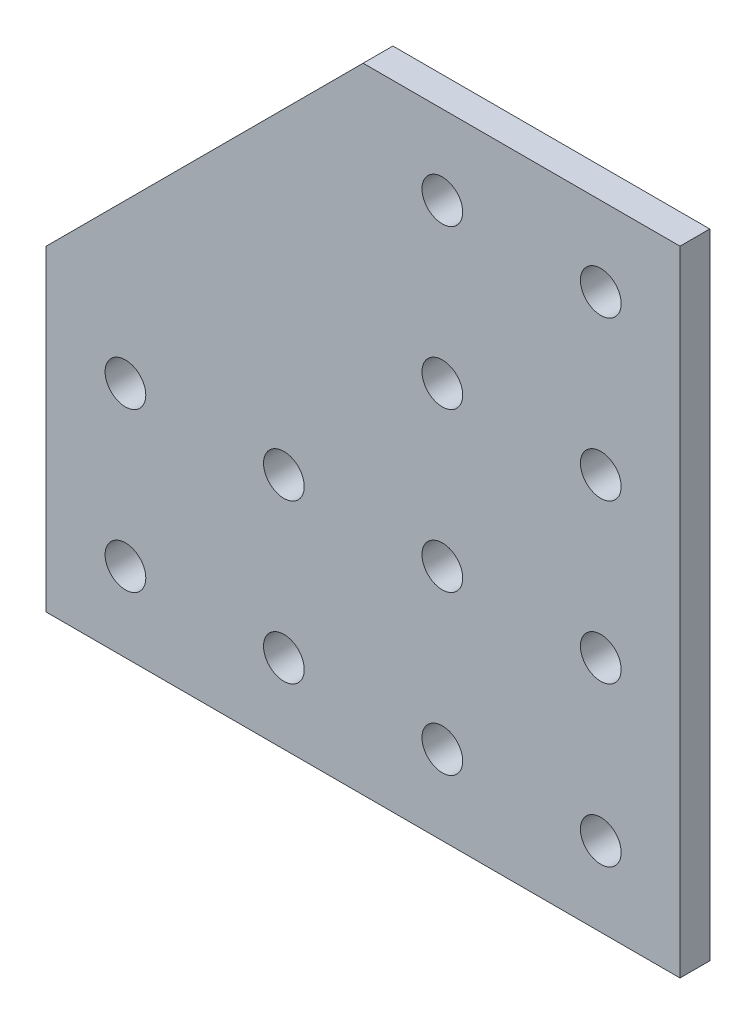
ISO-10303-21;
HEADER;
FILE_DESCRIPTION(('STEP AP214'),'2;1');
FILE_NAME('part.step','',(''),(''),'','','');
FILE_SCHEMA(('AUTOMOTIVE_DESIGN { 1 0 10303 214 1 1 1 1 }'));
ENDSEC;
DATA;
#1=APPLICATION_CONTEXT('core data for automotive mechanical design processes');
#2=APPLICATION_PROTOCOL_DEFINITION('international standard','automotive_design',2000,#1);
#3=PRODUCT_CONTEXT('',#1,'mechanical');
#4=PRODUCT('Part','Part','',(#3));
#5=PRODUCT_RELATED_PRODUCT_CATEGORY('part','',(#4));
#6=PRODUCT_DEFINITION_FORMATION('','',#4);
#7=PRODUCT_DEFINITION_CONTEXT('part definition',#1,'design');
#8=PRODUCT_DEFINITION('design','',#6,#7);
#9=PRODUCT_DEFINITION_SHAPE('','',#8);
#10=(LENGTH_UNIT() NAMED_UNIT(*) SI_UNIT(.MILLI.,.METRE.));
#11=(NAMED_UNIT(*) PLANE_ANGLE_UNIT() SI_UNIT($,.RADIAN.));
#12=(NAMED_UNIT(*) SI_UNIT($,.STERADIAN.) SOLID_ANGLE_UNIT());
#13=UNCERTAINTY_MEASURE_WITH_UNIT(LENGTH_MEASURE(1.E-05),#10,'distance_accuracy_value','');
#14=(GEOMETRIC_REPRESENTATION_CONTEXT(3) GLOBAL_UNCERTAINTY_ASSIGNED_CONTEXT((#13)) GLOBAL_UNIT_ASSIGNED_CONTEXT((#10,
#11,#12)) REPRESENTATION_CONTEXT('',''));
#15=CARTESIAN_POINT('',(0.,0.,0.));
#16=DIRECTION('',(0.,0.,1.));
#17=DIRECTION('',(1.,0.,0.));
#18=AXIS2_PLACEMENT_3D('',#15,#16,#17);
#19=CARTESIAN_POINT('',(1.11022302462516E-13,0.,4.77519999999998));
#20=DIRECTION('',(0.,0.,1.));
#21=DIRECTION('',(1.,0.,0.));
#22=AXIS2_PLACEMENT_3D('',#19,#20,#21);
#23=PLANE('',#22);
#24=CARTESIAN_POINT('',(-38.1,38.1,4.77520000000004));
#25=DIRECTION('',(0.,0.,1.));
#26=DIRECTION('',(1.,0.,0.));
#27=AXIS2_PLACEMENT_3D('',#24,#25,#26);
#28=CIRCLE('',#27,3.2639);
#29=CARTESIAN_POINT('',(-34.8361,38.1,4.77520000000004));
#30=VERTEX_POINT('',#29);
#31=EDGE_CURVE('E203',#30,#30,#28,.T.);
#32=ORIENTED_EDGE('',*,*,#31,.F.);
#33=EDGE_LOOP('',(#32));
#34=FACE_BOUND('',#33,.T.);
#35=CARTESIAN_POINT('',(-12.6999999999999,38.1,4.77519999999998));
#36=DIRECTION('',(0.,0.,1.));
#37=DIRECTION('',(1.,0.,0.));
#38=AXIS2_PLACEMENT_3D('',#35,#36,#37);
#39=CIRCLE('',#38,3.2639);
#40=CARTESIAN_POINT('',(-9.43609999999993,38.1,4.77519999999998));
#41=VERTEX_POINT('',#40);
#42=EDGE_CURVE('E215',#41,#41,#39,.T.);
#43=ORIENTED_EDGE('',*,*,#42,.F.);
#44=EDGE_LOOP('',(#43));
#45=FACE_BOUND('',#44,.T.);
#46=CARTESIAN_POINT('',(12.7,38.1,4.77519999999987));
#47=DIRECTION('',(0.,0.,1.));
#48=DIRECTION('',(1.,0.,0.));
#49=AXIS2_PLACEMENT_3D('',#46,#47,#48);
#50=CIRCLE('',#49,3.2639);
#51=CARTESIAN_POINT('',(15.9639,38.1,4.77519999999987));
#52=VERTEX_POINT('',#51);
#53=EDGE_CURVE('E227',#52,#52,#50,.T.);
#54=ORIENTED_EDGE('',*,*,#53,.F.);
#55=EDGE_LOOP('',(#54));
#56=FACE_BOUND('',#55,.T.);
#57=CARTESIAN_POINT('',(12.7,88.9,4.77519999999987));
#58=DIRECTION('',(0.,0.,1.));
#59=DIRECTION('',(1.,0.,0.));
#60=AXIS2_PLACEMENT_3D('',#57,#58,#59);
#61=CIRCLE('',#60,3.2639);
#62=CARTESIAN_POINT('',(15.9639,88.9,4.77519999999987));
#63=VERTEX_POINT('',#62);
#64=EDGE_CURVE('E239',#63,#63,#61,.T.);
#65=ORIENTED_EDGE('',*,*,#64,.F.);
#66=EDGE_LOOP('',(#65));
#67=FACE_BOUND('',#66,.T.);
#68=CARTESIAN_POINT('',(38.1000000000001,38.1,4.77519999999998));
#69=DIRECTION('',(0.,0.,1.));
#70=DIRECTION('',(1.,0.,0.));
#71=AXIS2_PLACEMENT_3D('',#68,#69,#70);
#72=CIRCLE('',#71,3.2639);
#73=CARTESIAN_POINT('',(41.3639000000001,38.1,4.77519999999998));
#74=VERTEX_POINT('',#73);
#75=EDGE_CURVE('E251',#74,#74,#72,.T.);
#76=ORIENTED_EDGE('',*,*,#75,.F.);
#77=EDGE_LOOP('',(#76));
#78=FACE_BOUND('',#77,.T.);
#79=CARTESIAN_POINT('',(38.1000000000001,88.9,4.77519999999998));
#80=DIRECTION('',(0.,0.,1.));
#81=DIRECTION('',(1.,0.,0.));
#82=AXIS2_PLACEMENT_3D('',#79,#80,#81);
#83=CIRCLE('',#82,3.2639);
#84=CARTESIAN_POINT('',(41.3639000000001,88.9,4.77519999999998));
#85=VERTEX_POINT('',#84);
#86=EDGE_CURVE('E110',#85,#85,#83,.T.);
#87=ORIENTED_EDGE('',*,*,#86,.F.);
#88=EDGE_LOOP('',(#87));
#89=FACE_BOUND('',#88,.T.);
#90=DIRECTION('',(0.,-1.,0.));
#91=VECTOR('',#90,1.);
#92=CARTESIAN_POINT('',(-50.7999999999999,50.8,4.77519999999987));
#93=LINE('',#92,#91);
#94=CARTESIAN_POINT('',(-50.7999999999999,50.8,4.77519999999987));
#95=VERTEX_POINT('',#94);
#96=CARTESIAN_POINT('',(-50.7999999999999,0.,4.77519999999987));
#97=VERTEX_POINT('',#96);
#98=EDGE_CURVE('E115',#95,#97,#93,.T.);
#99=ORIENTED_EDGE('',*,*,#98,.T.);
#100=DIRECTION('',(1.,0.,0.));
#101=VECTOR('',#100,1.);
#102=CARTESIAN_POINT('',(-50.7999999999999,0.,4.77519999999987));
#103=LINE('',#102,#101);
#104=CARTESIAN_POINT('',(50.8000000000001,0.,4.77519999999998));
#105=VERTEX_POINT('',#104);
#106=EDGE_CURVE('E82',#97,#105,#103,.T.);
#107=ORIENTED_EDGE('',*,*,#106,.T.);
#108=DIRECTION('',(0.,1.,0.));
#109=VECTOR('',#108,1.);
#110=CARTESIAN_POINT('',(50.8000000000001,0.,4.77519999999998));
#111=LINE('',#110,#109);
#112=CARTESIAN_POINT('',(50.8000000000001,101.6,4.77519999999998));
#113=VERTEX_POINT('',#112);
#114=EDGE_CURVE('E86',#105,#113,#111,.T.);
#115=ORIENTED_EDGE('',*,*,#114,.T.);
#116=DIRECTION('',(-1.,0.,0.));
#117=VECTOR('',#116,1.);
#118=CARTESIAN_POINT('',(50.8000000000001,101.6,4.77519999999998));
#119=LINE('',#118,#117);
#120=CARTESIAN_POINT('',(1.11022302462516E-13,101.6,4.77519999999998));
#121=VERTEX_POINT('',#120);
#122=EDGE_CURVE('E90',#113,#121,#119,.T.);
#123=ORIENTED_EDGE('',*,*,#122,.T.);
#124=DIRECTION('',(-0.707106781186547,-0.707106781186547,0.));
#125=VECTOR('',#124,1.);
#126=CARTESIAN_POINT('',(1.11022302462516E-13,101.6,4.77519999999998));
#127=LINE('',#126,#125);
#128=EDGE_CURVE('E48',#121,#95,#127,.T.);
#129=ORIENTED_EDGE('',*,*,#128,.T.);
#130=EDGE_LOOP('',(#99,#107,#115,#123,#129));
#131=FACE_BOUND('',#130,.T.);
#132=CARTESIAN_POINT('',(38.1000000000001,63.5,4.77519999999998));
#133=DIRECTION('',(0.,0.,1.));
#134=DIRECTION('',(1.,0.,0.));
#135=AXIS2_PLACEMENT_3D('',#132,#133,#134);
#136=CIRCLE('',#135,3.2639);
#137=CARTESIAN_POINT('',(41.3639000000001,63.5,4.77519999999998));
#138=VERTEX_POINT('',#137);
#139=EDGE_CURVE('E257',#138,#138,#136,.T.);
#140=ORIENTED_EDGE('',*,*,#139,.F.);
#141=EDGE_LOOP('',(#140));
#142=FACE_BOUND('',#141,.T.);
#143=CARTESIAN_POINT('',(38.1000000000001,12.7,4.77519999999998));
#144=DIRECTION('',(0.,0.,1.));
#145=DIRECTION('',(1.,0.,0.));
#146=AXIS2_PLACEMENT_3D('',#143,#144,#145);
#147=CIRCLE('',#146,3.2639);
#148=CARTESIAN_POINT('',(41.3639000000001,12.7,4.77519999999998));
#149=VERTEX_POINT('',#148);
#150=EDGE_CURVE('E245',#149,#149,#147,.T.);
#151=ORIENTED_EDGE('',*,*,#150,.F.);
#152=EDGE_LOOP('',(#151));
#153=FACE_BOUND('',#152,.T.);
#154=CARTESIAN_POINT('',(12.7,63.5,4.77519999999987));
#155=DIRECTION('',(0.,0.,1.));
#156=DIRECTION('',(1.,0.,0.));
#157=AXIS2_PLACEMENT_3D('',#154,#155,#156);
#158=CIRCLE('',#157,3.2639);
#159=CARTESIAN_POINT('',(15.9639,63.5,4.77519999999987));
#160=VERTEX_POINT('',#159);
#161=EDGE_CURVE('E233',#160,#160,#158,.T.);
#162=ORIENTED_EDGE('',*,*,#161,.F.);
#163=EDGE_LOOP('',(#162));
#164=FACE_BOUND('',#163,.T.);
#165=CARTESIAN_POINT('',(12.7,12.7,4.77519999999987));
#166=DIRECTION('',(0.,0.,1.));
#167=DIRECTION('',(1.,0.,0.));
#168=AXIS2_PLACEMENT_3D('',#165,#166,#167);
#169=CIRCLE('',#168,3.2639);
#170=CARTESIAN_POINT('',(15.9639,12.7,4.77519999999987));
#171=VERTEX_POINT('',#170);
#172=EDGE_CURVE('E221',#171,#171,#169,.T.);
#173=ORIENTED_EDGE('',*,*,#172,.F.);
#174=EDGE_LOOP('',(#173));
#175=FACE_BOUND('',#174,.T.);
#176=CARTESIAN_POINT('',(-12.6999999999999,12.7,4.77519999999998));
#177=DIRECTION('',(0.,0.,1.));
#178=DIRECTION('',(1.,0.,0.));
#179=AXIS2_PLACEMENT_3D('',#176,#177,#178);
#180=CIRCLE('',#179,3.2639);
#181=CARTESIAN_POINT('',(-9.43609999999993,12.7,4.77519999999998));
#182=VERTEX_POINT('',#181);
#183=EDGE_CURVE('E209',#182,#182,#180,.T.);
#184=ORIENTED_EDGE('',*,*,#183,.F.);
#185=EDGE_LOOP('',(#184));
#186=FACE_BOUND('',#185,.T.);
#187=CARTESIAN_POINT('',(-38.1,12.7,4.77520000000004));
#188=DIRECTION('',(0.,0.,1.));
#189=DIRECTION('',(1.,0.,0.));
#190=AXIS2_PLACEMENT_3D('',#187,#188,#189);
#191=CIRCLE('',#190,3.2639);
#192=CARTESIAN_POINT('',(-34.8361,12.7,4.77520000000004));
#193=VERTEX_POINT('',#192);
#194=EDGE_CURVE('E194',#193,#193,#191,.T.);
#195=ORIENTED_EDGE('',*,*,#194,.F.);
#196=EDGE_LOOP('',(#195));
#197=FACE_BOUND('',#196,.T.);
#198=ADVANCED_FACE('F31',(#34,#45,#56,#67,#78,#89,#131,#142,#153,#164,#175,#186,#197),#23,.T.);
#199=CARTESIAN_POINT('',(0.,0.,0.));
#200=DIRECTION('',(0.,0.,1.));
#201=DIRECTION('',(1.,0.,0.));
#202=AXIS2_PLACEMENT_3D('',#199,#200,#201);
#203=PLANE('',#202);
#204=CARTESIAN_POINT('',(-38.0999999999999,38.1,0.));
#205=DIRECTION('',(0.,0.,1.));
#206=DIRECTION('',(1.,0.,0.));
#207=AXIS2_PLACEMENT_3D('',#204,#205,#206);
#208=CIRCLE('',#207,3.2639);
#209=CARTESIAN_POINT('',(-34.8360999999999,38.1,0.));
#210=VERTEX_POINT('',#209);
#211=EDGE_CURVE('E200',#210,#210,#208,.T.);
#212=ORIENTED_EDGE('',*,*,#211,.T.);
#213=EDGE_LOOP('',(#212));
#214=FACE_BOUND('',#213,.T.);
#215=CARTESIAN_POINT('',(-12.7,38.1,0.));
#216=DIRECTION('',(0.,0.,1.));
#217=DIRECTION('',(1.,0.,0.));
#218=AXIS2_PLACEMENT_3D('',#215,#216,#217);
#219=CIRCLE('',#218,3.2639);
#220=CARTESIAN_POINT('',(-9.43609999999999,38.1,0.));
#221=VERTEX_POINT('',#220);
#222=EDGE_CURVE('E212',#221,#221,#219,.T.);
#223=ORIENTED_EDGE('',*,*,#222,.T.);
#224=EDGE_LOOP('',(#223));
#225=FACE_BOUND('',#224,.T.);
#226=CARTESIAN_POINT('',(12.7,38.1,-1.66533453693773E-13));
#227=DIRECTION('',(0.,0.,1.));
#228=DIRECTION('',(1.,0.,0.));
#229=AXIS2_PLACEMENT_3D('',#226,#227,#228);
#230=CIRCLE('',#229,3.2639);
#231=CARTESIAN_POINT('',(15.9639,38.1,-1.66533453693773E-13));
#232=VERTEX_POINT('',#231);
#233=EDGE_CURVE('E224',#232,#232,#230,.T.);
#234=ORIENTED_EDGE('',*,*,#233,.T.);
#235=EDGE_LOOP('',(#234));
#236=FACE_BOUND('',#235,.T.);
#237=CARTESIAN_POINT('',(12.7,88.9,-1.66533453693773E-13));
#238=DIRECTION('',(0.,0.,1.));
#239=DIRECTION('',(1.,0.,0.));
#240=AXIS2_PLACEMENT_3D('',#237,#238,#239);
#241=CIRCLE('',#240,3.2639);
#242=CARTESIAN_POINT('',(15.9639,88.9,-1.66533453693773E-13));
#243=VERTEX_POINT('',#242);
#244=EDGE_CURVE('E236',#243,#243,#241,.T.);
#245=ORIENTED_EDGE('',*,*,#244,.T.);
#246=EDGE_LOOP('',(#245));
#247=FACE_BOUND('',#246,.T.);
#248=CARTESIAN_POINT('',(38.1,38.1,0.));
#249=DIRECTION('',(0.,0.,1.));
#250=DIRECTION('',(1.,0.,0.));
#251=AXIS2_PLACEMENT_3D('',#248,#249,#250);
#252=CIRCLE('',#251,3.2639);
#253=CARTESIAN_POINT('',(41.3639,38.1,0.));
#254=VERTEX_POINT('',#253);
#255=EDGE_CURVE('E248',#254,#254,#252,.T.);
#256=ORIENTED_EDGE('',*,*,#255,.T.);
#257=EDGE_LOOP('',(#256));
#258=FACE_BOUND('',#257,.T.);
#259=CARTESIAN_POINT('',(38.1,88.9,0.));
#260=DIRECTION('',(0.,0.,1.));
#261=DIRECTION('',(1.,0.,0.));
#262=AXIS2_PLACEMENT_3D('',#259,#260,#261);
#263=CIRCLE('',#262,3.2639);
#264=CARTESIAN_POINT('',(41.3639,88.9,0.));
#265=VERTEX_POINT('',#264);
#266=EDGE_CURVE('E260',#265,#265,#263,.T.);
#267=ORIENTED_EDGE('',*,*,#266,.T.);
#268=EDGE_LOOP('',(#267));
#269=FACE_BOUND('',#268,.T.);
#270=DIRECTION('',(0.,-1.,0.));
#271=VECTOR('',#270,1.);
#272=CARTESIAN_POINT('',(-50.8,50.8,-1.66533453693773E-13));
#273=LINE('',#272,#271);
#274=CARTESIAN_POINT('',(-50.8,50.8,-1.66533453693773E-13));
#275=VERTEX_POINT('',#274);
#276=CARTESIAN_POINT('',(-50.8,0.,-1.66533453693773E-13));
#277=VERTEX_POINT('',#276);
#278=EDGE_CURVE('E106',#275,#277,#273,.T.);
#279=ORIENTED_EDGE('',*,*,#278,.F.);
#280=DIRECTION('',(-0.707106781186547,-0.707106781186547,0.));
#281=VECTOR('',#280,1.);
#282=CARTESIAN_POINT('',(0.,101.6,0.));
#283=LINE('',#282,#281);
#284=CARTESIAN_POINT('',(0.,101.6,0.));
#285=VERTEX_POINT('',#284);
#286=EDGE_CURVE('E74',#285,#275,#283,.T.);
#287=ORIENTED_EDGE('',*,*,#286,.F.);
#288=DIRECTION('',(-1.,0.,0.));
#289=VECTOR('',#288,1.);
#290=CARTESIAN_POINT('',(50.8,101.6,0.));
#291=LINE('',#290,#289);
#292=CARTESIAN_POINT('',(50.8,101.6,0.));
#293=VERTEX_POINT('',#292);
#294=EDGE_CURVE('E68',#293,#285,#291,.T.);
#295=ORIENTED_EDGE('',*,*,#294,.F.);
#296=DIRECTION('',(0.,1.,0.));
#297=VECTOR('',#296,1.);
#298=CARTESIAN_POINT('',(50.8,0.,0.));
#299=LINE('',#298,#297);
#300=CARTESIAN_POINT('',(50.8,0.,0.));
#301=VERTEX_POINT('',#300);
#302=EDGE_CURVE('E97',#301,#293,#299,.T.);
#303=ORIENTED_EDGE('',*,*,#302,.F.);
#304=DIRECTION('',(1.,0.,0.));
#305=VECTOR('',#304,1.);
#306=CARTESIAN_POINT('',(-50.8,0.,-1.66533453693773E-13));
#307=LINE('',#306,#305);
#308=EDGE_CURVE('E109',#277,#301,#307,.T.);
#309=ORIENTED_EDGE('',*,*,#308,.F.);
#310=EDGE_LOOP('',(#279,#287,#295,#303,#309));
#311=FACE_BOUND('',#310,.T.);
#312=CARTESIAN_POINT('',(38.1,63.5,0.));
#313=DIRECTION('',(0.,0.,1.));
#314=DIRECTION('',(1.,0.,0.));
#315=AXIS2_PLACEMENT_3D('',#312,#313,#314);
#316=CIRCLE('',#315,3.2639);
#317=CARTESIAN_POINT('',(41.3639,63.5,0.));
#318=VERTEX_POINT('',#317);
#319=EDGE_CURVE('E254',#318,#318,#316,.T.);
#320=ORIENTED_EDGE('',*,*,#319,.T.);
#321=EDGE_LOOP('',(#320));
#322=FACE_BOUND('',#321,.T.);
#323=CARTESIAN_POINT('',(38.1,12.7,0.));
#324=DIRECTION('',(0.,0.,1.));
#325=DIRECTION('',(1.,0.,0.));
#326=AXIS2_PLACEMENT_3D('',#323,#324,#325);
#327=CIRCLE('',#326,3.2639);
#328=CARTESIAN_POINT('',(41.3639,12.7,0.));
#329=VERTEX_POINT('',#328);
#330=EDGE_CURVE('E242',#329,#329,#327,.T.);
#331=ORIENTED_EDGE('',*,*,#330,.T.);
#332=EDGE_LOOP('',(#331));
#333=FACE_BOUND('',#332,.T.);
#334=CARTESIAN_POINT('',(12.7,63.5,-1.66533453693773E-13));
#335=DIRECTION('',(0.,0.,1.));
#336=DIRECTION('',(1.,0.,0.));
#337=AXIS2_PLACEMENT_3D('',#334,#335,#336);
#338=CIRCLE('',#337,3.2639);
#339=CARTESIAN_POINT('',(15.9639,63.5,-1.66533453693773E-13));
#340=VERTEX_POINT('',#339);
#341=EDGE_CURVE('E230',#340,#340,#338,.T.);
#342=ORIENTED_EDGE('',*,*,#341,.T.);
#343=EDGE_LOOP('',(#342));
#344=FACE_BOUND('',#343,.T.);
#345=CARTESIAN_POINT('',(12.7,12.7,-1.66533453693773E-13));
#346=DIRECTION('',(0.,0.,1.));
#347=DIRECTION('',(1.,0.,0.));
#348=AXIS2_PLACEMENT_3D('',#345,#346,#347);
#349=CIRCLE('',#348,3.2639);
#350=CARTESIAN_POINT('',(15.9639,12.7,-1.66533453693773E-13));
#351=VERTEX_POINT('',#350);
#352=EDGE_CURVE('E218',#351,#351,#349,.T.);
#353=ORIENTED_EDGE('',*,*,#352,.T.);
#354=EDGE_LOOP('',(#353));
#355=FACE_BOUND('',#354,.T.);
#356=CARTESIAN_POINT('',(-12.7,12.7,0.));
#357=DIRECTION('',(0.,0.,1.));
#358=DIRECTION('',(1.,0.,0.));
#359=AXIS2_PLACEMENT_3D('',#356,#357,#358);
#360=CIRCLE('',#359,3.2639);
#361=CARTESIAN_POINT('',(-9.43609999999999,12.7,0.));
#362=VERTEX_POINT('',#361);
#363=EDGE_CURVE('E206',#362,#362,#360,.T.);
#364=ORIENTED_EDGE('',*,*,#363,.T.);
#365=EDGE_LOOP('',(#364));
#366=FACE_BOUND('',#365,.T.);
#367=CARTESIAN_POINT('',(-38.0999999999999,12.7,0.));
#368=DIRECTION('',(0.,0.,1.));
#369=DIRECTION('',(1.,0.,0.));
#370=AXIS2_PLACEMENT_3D('',#367,#368,#369);
#371=CIRCLE('',#370,3.2639);
#372=CARTESIAN_POINT('',(-34.8360999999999,12.7,0.));
#373=VERTEX_POINT('',#372);
#374=EDGE_CURVE('E197',#373,#373,#371,.T.);
#375=ORIENTED_EDGE('',*,*,#374,.T.);
#376=EDGE_LOOP('',(#375));
#377=FACE_BOUND('',#376,.T.);
#378=ADVANCED_FACE('F119',(#214,#225,#236,#247,#258,#269,#311,#322,#333,#344,#355,#366,#377),
#203,.F.);
#379=CARTESIAN_POINT('',(-50.7999999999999,50.8,4.77519999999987));
#380=DIRECTION('',(1.,0.,0.));
#381=DIRECTION('',(0.,0.,-1.));
#382=AXIS2_PLACEMENT_3D('',#379,#380,#381);
#383=PLANE('',#382);
#384=ORIENTED_EDGE('',*,*,#278,.T.);
#385=DIRECTION('',(0.,0.,-1.));
#386=VECTOR('',#385,1.);
#387=CARTESIAN_POINT('',(-50.7999999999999,0.,4.77519999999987));
#388=LINE('',#387,#386);
#389=EDGE_CURVE('E11',#97,#277,#388,.T.);
#390=ORIENTED_EDGE('',*,*,#389,.F.);
#391=ORIENTED_EDGE('',*,*,#98,.F.);
#392=DIRECTION('',(0.,0.,-1.));
#393=VECTOR('',#392,1.);
#394=CARTESIAN_POINT('',(-50.7999999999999,50.8,4.77519999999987));
#395=LINE('',#394,#393);
#396=EDGE_CURVE('E102',#95,#275,#395,.T.);
#397=ORIENTED_EDGE('',*,*,#396,.T.);
#398=EDGE_LOOP('',(#384,#390,#391,#397));
#399=FACE_BOUND('',#398,.T.);
#400=ADVANCED_FACE('F33',(#399),#383,.F.);
#401=CARTESIAN_POINT('',(-50.7999999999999,0.,4.77519999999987));
#402=DIRECTION('',(0.,1.,0.));
#403=DIRECTION('',(0.,0.,1.));
#404=AXIS2_PLACEMENT_3D('',#401,#402,#403);
#405=PLANE('',#404);
#406=ORIENTED_EDGE('',*,*,#308,.T.);
#407=DIRECTION('',(0.,0.,-1.));
#408=VECTOR('',#407,1.);
#409=CARTESIAN_POINT('',(50.8000000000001,0.,4.77519999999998));
#410=LINE('',#409,#408);
#411=EDGE_CURVE('E40',#105,#301,#410,.T.);
#412=ORIENTED_EDGE('',*,*,#411,.F.);
#413=ORIENTED_EDGE('',*,*,#106,.F.);
#414=ORIENTED_EDGE('',*,*,#389,.T.);
#415=EDGE_LOOP('',(#406,#412,#413,#414));
#416=FACE_BOUND('',#415,.T.);
#417=ADVANCED_FACE('F374',(#416),#405,.F.);
#418=CARTESIAN_POINT('',(50.8000000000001,0.,4.77519999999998));
#419=DIRECTION('',(-1.,0.,0.));
#420=DIRECTION('',(0.,0.,1.));
#421=AXIS2_PLACEMENT_3D('',#418,#419,#420);
#422=PLANE('',#421);
#423=ORIENTED_EDGE('',*,*,#302,.T.);
#424=DIRECTION('',(0.,0.,-1.));
#425=VECTOR('',#424,1.);
#426=CARTESIAN_POINT('',(50.8000000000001,101.6,4.77519999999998));
#427=LINE('',#426,#425);
#428=EDGE_CURVE('E94',#113,#293,#427,.T.);
#429=ORIENTED_EDGE('',*,*,#428,.F.);
#430=ORIENTED_EDGE('',*,*,#114,.F.);
#431=ORIENTED_EDGE('',*,*,#411,.T.);
#432=EDGE_LOOP('',(#423,#429,#430,#431));
#433=FACE_BOUND('',#432,.T.);
#434=ADVANCED_FACE('F95',(#433),#422,.F.);
#435=CARTESIAN_POINT('',(50.8000000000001,101.6,4.77519999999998));
#436=DIRECTION('',(0.,-1.,0.));
#437=DIRECTION('',(0.,0.,-1.));
#438=AXIS2_PLACEMENT_3D('',#435,#436,#437);
#439=PLANE('',#438);
#440=ORIENTED_EDGE('',*,*,#294,.T.);
#441=DIRECTION('',(0.,0.,-1.));
#442=VECTOR('',#441,1.);
#443=CARTESIAN_POINT('',(1.11022302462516E-13,101.6,4.77519999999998));
#444=LINE('',#443,#442);
#445=EDGE_CURVE('E98',#121,#285,#444,.T.);
#446=ORIENTED_EDGE('',*,*,#445,.F.);
#447=ORIENTED_EDGE('',*,*,#122,.F.);
#448=ORIENTED_EDGE('',*,*,#428,.T.);
#449=EDGE_LOOP('',(#440,#446,#447,#448));
#450=FACE_BOUND('',#449,.T.);
#451=ADVANCED_FACE('F100',(#450),#439,.F.);
#452=CARTESIAN_POINT('',(1.11022302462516E-13,101.6,4.77519999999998));
#453=DIRECTION('',(0.707106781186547,-0.707106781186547,0.));
#454=DIRECTION('',(0.707106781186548,0.707106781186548,0.));
#455=AXIS2_PLACEMENT_3D('',#452,#453,#454);
#456=PLANE('',#455);
#457=ORIENTED_EDGE('',*,*,#286,.T.);
#458=ORIENTED_EDGE('',*,*,#396,.F.);
#459=ORIENTED_EDGE('',*,*,#128,.F.);
#460=ORIENTED_EDGE('',*,*,#445,.T.);
#461=EDGE_LOOP('',(#457,#458,#459,#460));
#462=FACE_BOUND('',#461,.T.);
#463=ADVANCED_FACE('F124',(#462),#456,.F.);
#464=CARTESIAN_POINT('',(38.1000000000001,88.9,4.77519999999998));
#465=DIRECTION('',(0.,0.,-1.));
#466=DIRECTION('',(-1.,0.,0.));
#467=AXIS2_PLACEMENT_3D('',#464,#465,#466);
#468=CYLINDRICAL_SURFACE('',#467,3.2639);
#469=ORIENTED_EDGE('',*,*,#86,.T.);
#470=EDGE_LOOP('',(#469));
#471=FACE_BOUND('',#470,.T.);
#472=ORIENTED_EDGE('',*,*,#266,.F.);
#473=EDGE_LOOP('',(#472));
#474=FACE_BOUND('',#473,.T.);
#475=ADVANCED_FACE('F126',(#471,#474),#468,.F.);
#476=CARTESIAN_POINT('',(38.1000000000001,63.5,4.77519999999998));
#477=DIRECTION('',(0.,0.,-1.));
#478=DIRECTION('',(-1.,0.,0.));
#479=AXIS2_PLACEMENT_3D('',#476,#477,#478);
#480=CYLINDRICAL_SURFACE('',#479,3.2639);
#481=ORIENTED_EDGE('',*,*,#139,.T.);
#482=EDGE_LOOP('',(#481));
#483=FACE_BOUND('',#482,.T.);
#484=ORIENTED_EDGE('',*,*,#319,.F.);
#485=EDGE_LOOP('',(#484));
#486=FACE_BOUND('',#485,.T.);
#487=ADVANCED_FACE('F132',(#483,#486),#480,.F.);
#488=CARTESIAN_POINT('',(38.1000000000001,38.1,4.77519999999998));
#489=DIRECTION('',(0.,0.,-1.));
#490=DIRECTION('',(-1.,0.,0.));
#491=AXIS2_PLACEMENT_3D('',#488,#489,#490);
#492=CYLINDRICAL_SURFACE('',#491,3.2639);
#493=ORIENTED_EDGE('',*,*,#75,.T.);
#494=EDGE_LOOP('',(#493));
#495=FACE_BOUND('',#494,.T.);
#496=ORIENTED_EDGE('',*,*,#255,.F.);
#497=EDGE_LOOP('',(#496));
#498=FACE_BOUND('',#497,.T.);
#499=ADVANCED_FACE('F149',(#495,#498),#492,.F.);
#500=CARTESIAN_POINT('',(38.1000000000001,12.7,4.77519999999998));
#501=DIRECTION('',(0.,0.,-1.));
#502=DIRECTION('',(-1.,0.,0.));
#503=AXIS2_PLACEMENT_3D('',#500,#501,#502);
#504=CYLINDRICAL_SURFACE('',#503,3.2639);
#505=ORIENTED_EDGE('',*,*,#150,.T.);
#506=EDGE_LOOP('',(#505));
#507=FACE_BOUND('',#506,.T.);
#508=ORIENTED_EDGE('',*,*,#330,.F.);
#509=EDGE_LOOP('',(#508));
#510=FACE_BOUND('',#509,.T.);
#511=ADVANCED_FACE('F153',(#507,#510),#504,.F.);
#512=CARTESIAN_POINT('',(12.7,88.9,4.77519999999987));
#513=DIRECTION('',(0.,0.,-1.));
#514=DIRECTION('',(-1.,0.,0.));
#515=AXIS2_PLACEMENT_3D('',#512,#513,#514);
#516=CYLINDRICAL_SURFACE('',#515,3.2639);
#517=ORIENTED_EDGE('',*,*,#64,.T.);
#518=EDGE_LOOP('',(#517));
#519=FACE_BOUND('',#518,.T.);
#520=ORIENTED_EDGE('',*,*,#244,.F.);
#521=EDGE_LOOP('',(#520));
#522=FACE_BOUND('',#521,.T.);
#523=ADVANCED_FACE('F157',(#519,#522),#516,.F.);
#524=CARTESIAN_POINT('',(12.7,63.5,4.77519999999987));
#525=DIRECTION('',(0.,0.,-1.));
#526=DIRECTION('',(-1.,0.,0.));
#527=AXIS2_PLACEMENT_3D('',#524,#525,#526);
#528=CYLINDRICAL_SURFACE('',#527,3.2639);
#529=ORIENTED_EDGE('',*,*,#161,.T.);
#530=EDGE_LOOP('',(#529));
#531=FACE_BOUND('',#530,.T.);
#532=ORIENTED_EDGE('',*,*,#341,.F.);
#533=EDGE_LOOP('',(#532));
#534=FACE_BOUND('',#533,.T.);
#535=ADVANCED_FACE('F161',(#531,#534),#528,.F.);
#536=CARTESIAN_POINT('',(12.7,38.1,4.77519999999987));
#537=DIRECTION('',(0.,0.,-1.));
#538=DIRECTION('',(-1.,0.,0.));
#539=AXIS2_PLACEMENT_3D('',#536,#537,#538);
#540=CYLINDRICAL_SURFACE('',#539,3.2639);
#541=ORIENTED_EDGE('',*,*,#53,.T.);
#542=EDGE_LOOP('',(#541));
#543=FACE_BOUND('',#542,.T.);
#544=ORIENTED_EDGE('',*,*,#233,.F.);
#545=EDGE_LOOP('',(#544));
#546=FACE_BOUND('',#545,.T.);
#547=ADVANCED_FACE('F165',(#543,#546),#540,.F.);
#548=CARTESIAN_POINT('',(12.7,12.7,4.77519999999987));
#549=DIRECTION('',(0.,0.,-1.));
#550=DIRECTION('',(-1.,0.,0.));
#551=AXIS2_PLACEMENT_3D('',#548,#549,#550);
#552=CYLINDRICAL_SURFACE('',#551,3.2639);
#553=ORIENTED_EDGE('',*,*,#172,.T.);
#554=EDGE_LOOP('',(#553));
#555=FACE_BOUND('',#554,.T.);
#556=ORIENTED_EDGE('',*,*,#352,.F.);
#557=EDGE_LOOP('',(#556));
#558=FACE_BOUND('',#557,.T.);
#559=ADVANCED_FACE('F169',(#555,#558),#552,.F.);
#560=CARTESIAN_POINT('',(-12.6999999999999,38.1,4.77519999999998));
#561=DIRECTION('',(0.,0.,-1.));
#562=DIRECTION('',(-1.,0.,0.));
#563=AXIS2_PLACEMENT_3D('',#560,#561,#562);
#564=CYLINDRICAL_SURFACE('',#563,3.2639);
#565=ORIENTED_EDGE('',*,*,#42,.T.);
#566=EDGE_LOOP('',(#565));
#567=FACE_BOUND('',#566,.T.);
#568=ORIENTED_EDGE('',*,*,#222,.F.);
#569=EDGE_LOOP('',(#568));
#570=FACE_BOUND('',#569,.T.);
#571=ADVANCED_FACE('F173',(#567,#570),#564,.F.);
#572=CARTESIAN_POINT('',(-12.6999999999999,12.7,4.77519999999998));
#573=DIRECTION('',(0.,0.,-1.));
#574=DIRECTION('',(-1.,0.,0.));
#575=AXIS2_PLACEMENT_3D('',#572,#573,#574);
#576=CYLINDRICAL_SURFACE('',#575,3.2639);
#577=ORIENTED_EDGE('',*,*,#183,.T.);
#578=EDGE_LOOP('',(#577));
#579=FACE_BOUND('',#578,.T.);
#580=ORIENTED_EDGE('',*,*,#363,.F.);
#581=EDGE_LOOP('',(#580));
#582=FACE_BOUND('',#581,.T.);
#583=ADVANCED_FACE('F177',(#579,#582),#576,.F.);
#584=CARTESIAN_POINT('',(-38.1,38.1,4.77520000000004));
#585=DIRECTION('',(0.,0.,-1.));
#586=DIRECTION('',(-1.,0.,0.));
#587=AXIS2_PLACEMENT_3D('',#584,#585,#586);
#588=CYLINDRICAL_SURFACE('',#587,3.2639);
#589=ORIENTED_EDGE('',*,*,#31,.T.);
#590=EDGE_LOOP('',(#589));
#591=FACE_BOUND('',#590,.T.);
#592=ORIENTED_EDGE('',*,*,#211,.F.);
#593=EDGE_LOOP('',(#592));
#594=FACE_BOUND('',#593,.T.);
#595=ADVANCED_FACE('F181',(#591,#594),#588,.F.);
#596=CARTESIAN_POINT('',(-38.1,12.7,4.77520000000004));
#597=DIRECTION('',(0.,0.,-1.));
#598=DIRECTION('',(-1.,0.,0.));
#599=AXIS2_PLACEMENT_3D('',#596,#597,#598);
#600=CYLINDRICAL_SURFACE('',#599,3.2639);
#601=ORIENTED_EDGE('',*,*,#194,.T.);
#602=EDGE_LOOP('',(#601));
#603=FACE_BOUND('',#602,.T.);
#604=ORIENTED_EDGE('',*,*,#374,.F.);
#605=EDGE_LOOP('',(#604));
#606=FACE_BOUND('',#605,.T.);
#607=ADVANCED_FACE('F185',(#603,#606),#600,.F.);
#608=CLOSED_SHELL('',(#198,#378,#400,#417,#434,#451,#463,#475,#487,#499,#511,#523,#535,#547,
#559,#571,#583,#595,#607));
#609=MANIFOLD_SOLID_BREP('B2',#608);
#610=ADVANCED_BREP_SHAPE_REPRESENTATION('',(#18,#609),#14);
#611=SHAPE_DEFINITION_REPRESENTATION(#9,#610);
ENDSEC;
END-ISO-10303-21;
